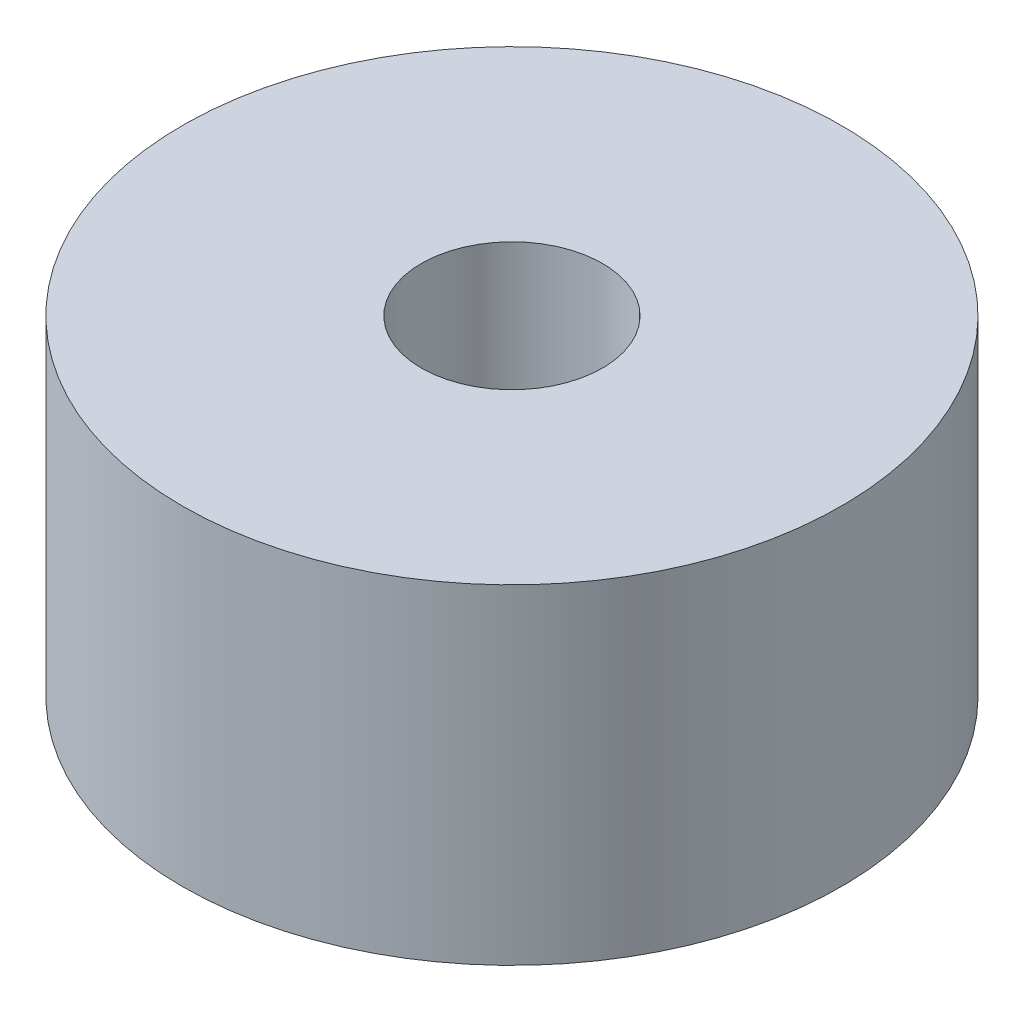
from build123d import *

# Parameters (mm, degrees)
SKIZZE1_R                       = 4
SKIZZE1_R_2                     = 1.1
AUFSATZ_LINEAR_AUSTRAGEN1_DEPTH = 4


with BuildPart() as part:
    # Skizze1 → Aufsatz-Linear austragen1 (new body)
    with BuildSketch(Plane(origin=(0, 0, 0), x_dir=(1, 0, 0), z_dir=(0, 1, 0))):
        with Locations(Location((-4.5, 0, 0), (0, 0, 270))):
            Circle(SKIZZE1_R)
        with Locations(Location((-4.5, 0, 0), (0, 0, 270))):
            Circle(SKIZZE1_R_2, mode=Mode.SUBTRACT)
    extrude(amount=AUFSATZ_LINEAR_AUSTRAGEN1_DEPTH)


solid = part.part
